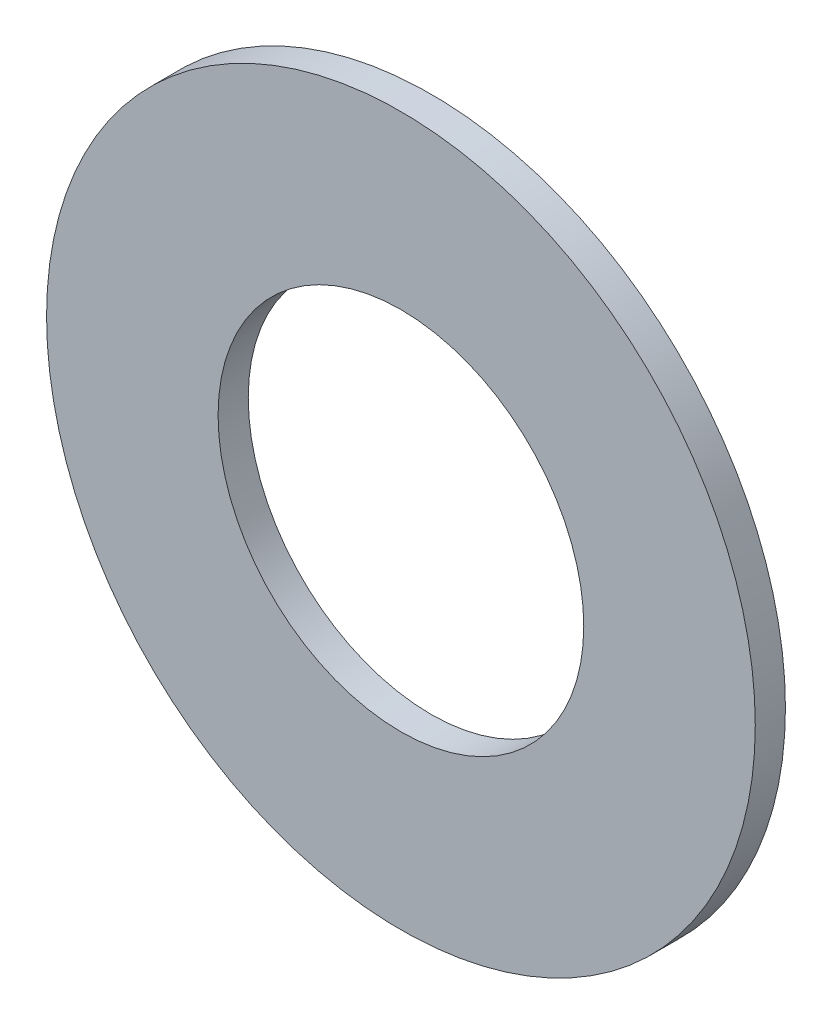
from build123d import *

# Parameters (mm, degrees)
SKETCH1_R          = 11.938
SKETCH1_R_2        = 6.1595
BASE_EXTRUDE_DEPTH = 1.016


with BuildPart() as part:
    # Sketch1 → Base-Extrude (new body)
    with BuildSketch(Plane.XY):
        Circle(SKETCH1_R)
        Circle(SKETCH1_R_2, mode=Mode.SUBTRACT)
    extrude(amount=BASE_EXTRUDE_DEPTH)


solid = part.part
